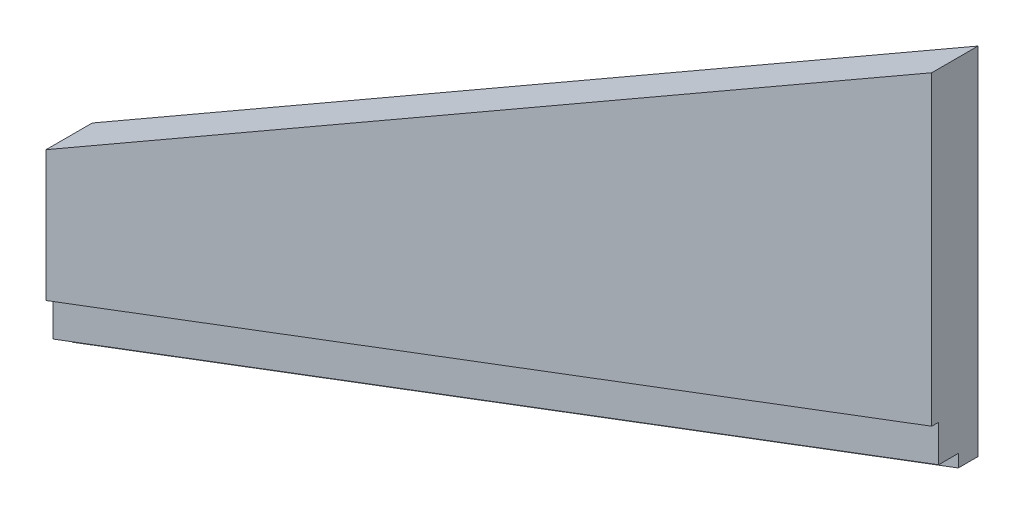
from build123d import *

# Parameters (mm, degrees)
EXTRUDE_1_DEPTH = 47
EXTRUDE_2_DEPTH = 40
EXTRUDE_3_DEPTH = 20


with BuildPart() as part:
    # Sketch 1 → Extrude 1 (new body)
    with BuildSketch(Plane.XY):
        Polygon((-900, -1138.487052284), (-900, -1271.209662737), (0, -931.846836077), (0, -620.780305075), align=None)
    extrude(amount=EXTRUDE_1_DEPTH)

    # Sketch 2 → Extrude 2 (add)
    with BuildSketch(Plane(origin=(0, 0, 0), x_dir=(-1, 0, 0), z_dir=(0, 0, -1))):
        Polygon((0, -931.846836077), (0, -969.252350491), (900, -1308.615177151), (900, -1271.209662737), align=None)
    extrude(amount=-EXTRUDE_2_DEPTH)

    # Sketch 3 → Extrude 3 (add)
    with BuildSketch(Plane(origin=(0, 0, 0), x_dir=(-1, 0, 0), z_dir=(0, 0, -1))):
        Polygon((0, -969.252350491), (0, -982.07709829), (900, -1321.43992495), (900, -1308.615177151), align=None)
    extrude(amount=-EXTRUDE_3_DEPTH)


solid = part.part
